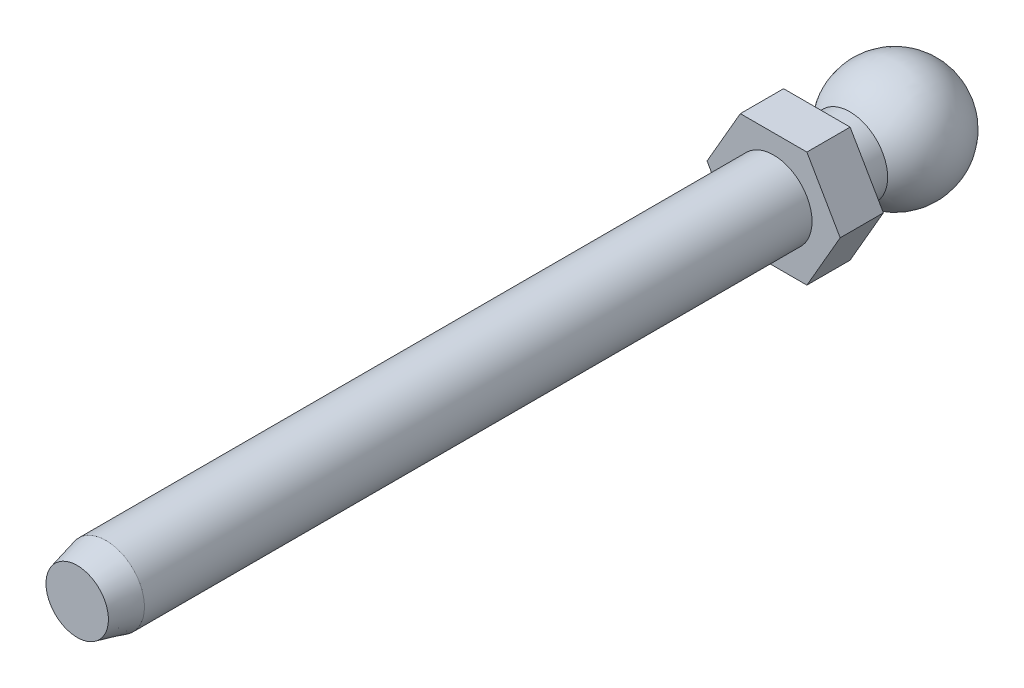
ISO-10303-21;
HEADER;
FILE_DESCRIPTION(('STEP AP214'),'2;1');
FILE_NAME('part.step','',(''),(''),'','','');
FILE_SCHEMA(('AUTOMOTIVE_DESIGN { 1 0 10303 214 1 1 1 1 }'));
ENDSEC;
DATA;
#1=APPLICATION_CONTEXT('core data for automotive mechanical design processes');
#2=APPLICATION_PROTOCOL_DEFINITION('international standard','automotive_design',2000,#1);
#3=PRODUCT_CONTEXT('',#1,'mechanical');
#4=PRODUCT('Part','Part','',(#3));
#5=PRODUCT_RELATED_PRODUCT_CATEGORY('part','',(#4));
#6=PRODUCT_DEFINITION_FORMATION('','',#4);
#7=PRODUCT_DEFINITION_CONTEXT('part definition',#1,'design');
#8=PRODUCT_DEFINITION('design','',#6,#7);
#9=PRODUCT_DEFINITION_SHAPE('','',#8);
#10=(LENGTH_UNIT() NAMED_UNIT(*) SI_UNIT(.MILLI.,.METRE.));
#11=(NAMED_UNIT(*) PLANE_ANGLE_UNIT() SI_UNIT($,.RADIAN.));
#12=(NAMED_UNIT(*) SI_UNIT($,.STERADIAN.) SOLID_ANGLE_UNIT());
#13=UNCERTAINTY_MEASURE_WITH_UNIT(LENGTH_MEASURE(1.E-05),#10,'distance_accuracy_value','');
#14=(GEOMETRIC_REPRESENTATION_CONTEXT(3) GLOBAL_UNCERTAINTY_ASSIGNED_CONTEXT((#13)) GLOBAL_UNIT_ASSIGNED_CONTEXT((#10,
#11,#12)) REPRESENTATION_CONTEXT('',''));
#15=CARTESIAN_POINT('',(0.,0.,0.));
#16=DIRECTION('',(0.,0.,1.));
#17=DIRECTION('',(1.,0.,0.));
#18=AXIS2_PLACEMENT_3D('',#15,#16,#17);
#19=CARTESIAN_POINT('',(0.,0.,0.));
#20=DIRECTION('',(1.,0.,0.));
#21=DIRECTION('',(0.,1.,0.));
#22=AXIS2_PLACEMENT_3D('',#19,#20,#21);
#23=SPHERICAL_SURFACE('',#22,12.25);
#24=CARTESIAN_POINT('',(-12.25,0.,0.));
#25=VERTEX_POINT('',#24);
#26=VERTEX_LOOP('',#25);
#27=FACE_BOUND('',#26,.T.);
#28=CARTESIAN_POINT('',(12.25,0.,0.));
#29=VERTEX_POINT('',#28);
#30=VERTEX_LOOP('',#29);
#31=FACE_BOUND('',#30,.T.);
#32=CARTESIAN_POINT('',(0.,0.,9.38332963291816));
#33=DIRECTION('',(0.,0.,1.));
#34=DIRECTION('',(1.,0.,0.));
#35=AXIS2_PLACEMENT_3D('',#32,#33,#34);
#36=CIRCLE('',#35,7.875);
#37=CARTESIAN_POINT('',(7.875,0.,9.38332963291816));
#38=VERTEX_POINT('',#37);
#39=EDGE_CURVE('E20',#38,#38,#36,.T.);
#40=ORIENTED_EDGE('',*,*,#39,.F.);
#41=EDGE_LOOP('',(#40));
#42=FACE_BOUND('',#41,.T.);
#43=ADVANCED_FACE('F16',(#27,#31,#42),#23,.T.);
#44=CARTESIAN_POINT('',(0.,0.,0.));
#45=DIRECTION('',(0.,0.,1.));
#46=DIRECTION('',(1.,0.,0.));
#47=AXIS2_PLACEMENT_3D('',#44,#45,#46);
#48=CYLINDRICAL_SURFACE('',#47,7.875);
#49=ORIENTED_EDGE('',*,*,#39,.T.);
#50=EDGE_LOOP('',(#49));
#51=FACE_BOUND('',#50,.T.);
#52=CARTESIAN_POINT('',(0.,0.,16.25));
#53=DIRECTION('',(0.,0.,1.));
#54=DIRECTION('',(1.,0.,0.));
#55=AXIS2_PLACEMENT_3D('',#52,#53,#54);
#56=CIRCLE('',#55,7.875);
#57=CARTESIAN_POINT('',(7.875,0.,16.25));
#58=VERTEX_POINT('',#57);
#59=EDGE_CURVE('E79',#58,#58,#56,.F.);
#60=ORIENTED_EDGE('',*,*,#59,.T.);
#61=EDGE_LOOP('',(#60));
#62=FACE_BOUND('',#61,.T.);
#63=ADVANCED_FACE('F74',(#51,#62),#48,.T.);
#64=CARTESIAN_POINT('',(0.,0.,16.25));
#65=DIRECTION('',(0.,0.,1.));
#66=DIRECTION('',(1.,0.,0.));
#67=AXIS2_PLACEMENT_3D('',#64,#65,#66);
#68=PLANE('',#67);
#69=ORIENTED_EDGE('',*,*,#59,.F.);
#70=EDGE_LOOP('',(#69));
#71=FACE_BOUND('',#70,.T.);
#72=DIRECTION('',(-0.5,0.866025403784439,0.));
#73=VECTOR('',#72,1.);
#74=CARTESIAN_POINT('',(6.92820323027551,12.,16.25));
#75=LINE('',#74,#73);
#76=CARTESIAN_POINT('',(13.856406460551,0.,16.25));
#77=VERTEX_POINT('',#76);
#78=CARTESIAN_POINT('',(6.92820323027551,12.,16.25));
#79=VERTEX_POINT('',#78);
#80=EDGE_CURVE('E81',#77,#79,#75,.T.);
#81=ORIENTED_EDGE('',*,*,#80,.F.);
#82=DIRECTION('',(0.5,0.866025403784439,0.));
#83=VECTOR('',#82,1.);
#84=CARTESIAN_POINT('',(13.856406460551,0.,16.25));
#85=LINE('',#84,#83);
#86=CARTESIAN_POINT('',(6.92820323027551,-12.,16.25));
#87=VERTEX_POINT('',#86);
#88=EDGE_CURVE('E114',#87,#77,#85,.T.);
#89=ORIENTED_EDGE('',*,*,#88,.F.);
#90=DIRECTION('',(1.,0.,0.));
#91=VECTOR('',#90,1.);
#92=CARTESIAN_POINT('',(6.92820323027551,-12.,16.25));
#93=LINE('',#92,#91);
#94=CARTESIAN_POINT('',(-6.92820323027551,-12.,16.25));
#95=VERTEX_POINT('',#94);
#96=EDGE_CURVE('E111',#95,#87,#93,.T.);
#97=ORIENTED_EDGE('',*,*,#96,.F.);
#98=DIRECTION('',(0.5,-0.866025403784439,0.));
#99=VECTOR('',#98,1.);
#100=CARTESIAN_POINT('',(-6.92820323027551,-12.,16.25));
#101=LINE('',#100,#99);
#102=CARTESIAN_POINT('',(-13.856406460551,0.,16.25));
#103=VERTEX_POINT('',#102);
#104=EDGE_CURVE('E106',#103,#95,#101,.T.);
#105=ORIENTED_EDGE('',*,*,#104,.F.);
#106=DIRECTION('',(-0.5,-0.866025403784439,0.));
#107=VECTOR('',#106,1.);
#108=CARTESIAN_POINT('',(-13.856406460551,0.,16.25));
#109=LINE('',#108,#107);
#110=CARTESIAN_POINT('',(-6.92820323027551,12.,16.25));
#111=VERTEX_POINT('',#110);
#112=EDGE_CURVE('E101',#111,#103,#109,.T.);
#113=ORIENTED_EDGE('',*,*,#112,.F.);
#114=DIRECTION('',(1.,0.,0.));
#115=VECTOR('',#114,1.);
#116=CARTESIAN_POINT('',(-6.92820323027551,12.,16.25));
#117=LINE('',#116,#115);
#118=EDGE_CURVE('E96',#79,#111,#117,.F.);
#119=ORIENTED_EDGE('',*,*,#118,.F.);
#120=EDGE_LOOP('',(#81,#89,#97,#105,#113,#119));
#121=FACE_BOUND('',#120,.T.);
#122=ADVANCED_FACE('F235',(#71,#121),#68,.F.);
#123=CARTESIAN_POINT('',(6.92820323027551,12.,16.25));
#124=DIRECTION('',(0.866025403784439,0.5,0.));
#125=DIRECTION('',(-0.5,0.866025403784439,0.));
#126=AXIS2_PLACEMENT_3D('',#123,#124,#125);
#127=PLANE('',#126);
#128=ORIENTED_EDGE('',*,*,#80,.T.);
#129=DIRECTION('',(0.,0.,1.));
#130=VECTOR('',#129,1.);
#131=CARTESIAN_POINT('',(6.92820323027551,12.,16.25));
#132=LINE('',#131,#130);
#133=CARTESIAN_POINT('',(6.92820323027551,12.,25.25));
#134=VERTEX_POINT('',#133);
#135=EDGE_CURVE('E84',#134,#79,#132,.F.);
#136=ORIENTED_EDGE('',*,*,#135,.F.);
#137=DIRECTION('',(-0.5,0.866025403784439,0.));
#138=VECTOR('',#137,1.);
#139=CARTESIAN_POINT('',(13.856406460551,0.,25.25));
#140=LINE('',#139,#138);
#141=CARTESIAN_POINT('',(13.856406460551,0.,25.25));
#142=VERTEX_POINT('',#141);
#143=EDGE_CURVE('E120',#142,#134,#140,.T.);
#144=ORIENTED_EDGE('',*,*,#143,.F.);
#145=DIRECTION('',(0.,0.,1.));
#146=VECTOR('',#145,1.);
#147=CARTESIAN_POINT('',(13.856406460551,0.,16.25));
#148=LINE('',#147,#146);
#149=EDGE_CURVE('E117',#77,#142,#148,.T.);
#150=ORIENTED_EDGE('',*,*,#149,.F.);
#151=EDGE_LOOP('',(#128,#136,#144,#150));
#152=FACE_BOUND('',#151,.T.);
#153=ADVANCED_FACE('F145',(#152),#127,.T.);
#154=CARTESIAN_POINT('',(-6.92820323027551,12.,16.25));
#155=DIRECTION('',(0.,1.,0.));
#156=DIRECTION('',(0.,0.,1.));
#157=AXIS2_PLACEMENT_3D('',#154,#155,#156);
#158=PLANE('',#157);
#159=ORIENTED_EDGE('',*,*,#118,.T.);
#160=DIRECTION('',(0.,0.,1.));
#161=VECTOR('',#160,1.);
#162=CARTESIAN_POINT('',(-6.92820323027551,12.,16.25));
#163=LINE('',#162,#161);
#164=CARTESIAN_POINT('',(-6.92820323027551,12.,25.25));
#165=VERTEX_POINT('',#164);
#166=EDGE_CURVE('E98',#165,#111,#163,.F.);
#167=ORIENTED_EDGE('',*,*,#166,.F.);
#168=DIRECTION('',(1.,0.,0.));
#169=VECTOR('',#168,1.);
#170=CARTESIAN_POINT('',(0.,12.,25.25));
#171=LINE('',#170,#169);
#172=EDGE_CURVE('E123',#134,#165,#171,.F.);
#173=ORIENTED_EDGE('',*,*,#172,.F.);
#174=ORIENTED_EDGE('',*,*,#135,.T.);
#175=EDGE_LOOP('',(#159,#167,#173,#174));
#176=FACE_BOUND('',#175,.T.);
#177=ADVANCED_FACE('F149',(#176),#158,.T.);
#178=CARTESIAN_POINT('',(-13.856406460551,0.,16.25));
#179=DIRECTION('',(-0.866025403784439,0.5,0.));
#180=DIRECTION('',(-0.5,-0.866025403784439,0.));
#181=AXIS2_PLACEMENT_3D('',#178,#179,#180);
#182=PLANE('',#181);
#183=ORIENTED_EDGE('',*,*,#112,.T.);
#184=DIRECTION('',(0.,0.,1.));
#185=VECTOR('',#184,1.);
#186=CARTESIAN_POINT('',(-13.856406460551,0.,16.25));
#187=LINE('',#186,#185);
#188=CARTESIAN_POINT('',(-13.856406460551,0.,25.25));
#189=VERTEX_POINT('',#188);
#190=EDGE_CURVE('E103',#189,#103,#187,.F.);
#191=ORIENTED_EDGE('',*,*,#190,.F.);
#192=DIRECTION('',(-0.5,-0.866025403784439,0.));
#193=VECTOR('',#192,1.);
#194=CARTESIAN_POINT('',(-6.92820323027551,12.,25.25));
#195=LINE('',#194,#193);
#196=EDGE_CURVE('E126',#165,#189,#195,.T.);
#197=ORIENTED_EDGE('',*,*,#196,.F.);
#198=ORIENTED_EDGE('',*,*,#166,.T.);
#199=EDGE_LOOP('',(#183,#191,#197,#198));
#200=FACE_BOUND('',#199,.T.);
#201=ADVANCED_FACE('F153',(#200),#182,.T.);
#202=CARTESIAN_POINT('',(-6.92820323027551,-12.,16.25));
#203=DIRECTION('',(-0.866025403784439,-0.5,0.));
#204=DIRECTION('',(0.5,-0.866025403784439,0.));
#205=AXIS2_PLACEMENT_3D('',#202,#203,#204);
#206=PLANE('',#205);
#207=ORIENTED_EDGE('',*,*,#104,.T.);
#208=DIRECTION('',(0.,0.,-1.));
#209=VECTOR('',#208,1.);
#210=CARTESIAN_POINT('',(-6.92820323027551,-12.,16.25));
#211=LINE('',#210,#209);
#212=CARTESIAN_POINT('',(-6.92820323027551,-12.,25.25));
#213=VERTEX_POINT('',#212);
#214=EDGE_CURVE('E108',#213,#95,#211,.T.);
#215=ORIENTED_EDGE('',*,*,#214,.F.);
#216=DIRECTION('',(0.5,-0.866025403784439,0.));
#217=VECTOR('',#216,1.);
#218=CARTESIAN_POINT('',(-13.856406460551,0.,25.25));
#219=LINE('',#218,#217);
#220=EDGE_CURVE('E129',#189,#213,#219,.T.);
#221=ORIENTED_EDGE('',*,*,#220,.F.);
#222=ORIENTED_EDGE('',*,*,#190,.T.);
#223=EDGE_LOOP('',(#207,#215,#221,#222));
#224=FACE_BOUND('',#223,.T.);
#225=ADVANCED_FACE('F157',(#224),#206,.T.);
#226=CARTESIAN_POINT('',(6.92820323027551,-12.,16.25));
#227=DIRECTION('',(0.,-1.,0.));
#228=DIRECTION('',(0.,0.,-1.));
#229=AXIS2_PLACEMENT_3D('',#226,#227,#228);
#230=PLANE('',#229);
#231=ORIENTED_EDGE('',*,*,#96,.T.);
#232=DIRECTION('',(0.,0.,1.));
#233=VECTOR('',#232,1.);
#234=CARTESIAN_POINT('',(6.92820323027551,-12.,16.25));
#235=LINE('',#234,#233);
#236=CARTESIAN_POINT('',(6.92820323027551,-12.,25.25));
#237=VERTEX_POINT('',#236);
#238=EDGE_CURVE('E35',#237,#87,#235,.F.);
#239=ORIENTED_EDGE('',*,*,#238,.F.);
#240=DIRECTION('',(1.,0.,0.));
#241=VECTOR('',#240,1.);
#242=CARTESIAN_POINT('',(0.,-12.,25.25));
#243=LINE('',#242,#241);
#244=EDGE_CURVE('E132',#213,#237,#243,.T.);
#245=ORIENTED_EDGE('',*,*,#244,.F.);
#246=ORIENTED_EDGE('',*,*,#214,.T.);
#247=EDGE_LOOP('',(#231,#239,#245,#246));
#248=FACE_BOUND('',#247,.T.);
#249=ADVANCED_FACE('F159',(#248),#230,.T.);
#250=CARTESIAN_POINT('',(13.856406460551,0.,16.25));
#251=DIRECTION('',(0.866025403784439,-0.5,0.));
#252=DIRECTION('',(0.5,0.866025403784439,0.));
#253=AXIS2_PLACEMENT_3D('',#250,#251,#252);
#254=PLANE('',#253);
#255=ORIENTED_EDGE('',*,*,#88,.T.);
#256=ORIENTED_EDGE('',*,*,#149,.T.);
#257=DIRECTION('',(0.5,0.866025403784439,0.));
#258=VECTOR('',#257,1.);
#259=CARTESIAN_POINT('',(6.92820323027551,-12.,25.25));
#260=LINE('',#259,#258);
#261=EDGE_CURVE('E90',#237,#142,#260,.T.);
#262=ORIENTED_EDGE('',*,*,#261,.F.);
#263=ORIENTED_EDGE('',*,*,#238,.T.);
#264=EDGE_LOOP('',(#255,#256,#262,#263));
#265=FACE_BOUND('',#264,.T.);
#266=ADVANCED_FACE('F141',(#265),#254,.T.);
#267=CARTESIAN_POINT('',(0.,0.,170.25));
#268=DIRECTION('',(0.,0.,-1.));
#269=DIRECTION('',(-1.,0.,0.));
#270=AXIS2_PLACEMENT_3D('',#267,#268,#269);
#271=PLANE('',#270);
#272=CARTESIAN_POINT('',(0.,0.,170.25000000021));
#273=DIRECTION('',(0.,0.,-1.));
#274=DIRECTION('',(0.,1.,0.));
#275=AXIS2_PLACEMENT_3D('',#272,#273,#274);
#276=CIRCLE('',#275,6.50000000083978);
#277=CARTESIAN_POINT('',(0.,6.50000000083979,170.25000000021));
#278=VERTEX_POINT('',#277);
#279=EDGE_CURVE('E87',#278,#278,#276,.T.);
#280=ORIENTED_EDGE('',*,*,#279,.F.);
#281=EDGE_LOOP('',(#280));
#282=FACE_BOUND('',#281,.T.);
#283=ADVANCED_FACE('F167',(#282),#271,.F.);
#284=CARTESIAN_POINT('',(0.,0.,25.25));
#285=DIRECTION('',(0.,0.,1.));
#286=DIRECTION('',(1.,0.,0.));
#287=AXIS2_PLACEMENT_3D('',#284,#285,#286);
#288=PLANE('',#287);
#289=CARTESIAN_POINT('',(0.,0.,25.25));
#290=DIRECTION('',(0.,0.,1.));
#291=DIRECTION('',(1.,0.,0.));
#292=AXIS2_PLACEMENT_3D('',#289,#290,#291);
#293=CIRCLE('',#292,8.);
#294=CARTESIAN_POINT('',(8.,0.,25.25));
#295=VERTEX_POINT('',#294);
#296=EDGE_CURVE('E26',#295,#295,#293,.T.);
#297=ORIENTED_EDGE('',*,*,#296,.F.);
#298=EDGE_LOOP('',(#297));
#299=FACE_BOUND('',#298,.T.);
#300=ORIENTED_EDGE('',*,*,#244,.T.);
#301=ORIENTED_EDGE('',*,*,#261,.T.);
#302=ORIENTED_EDGE('',*,*,#143,.T.);
#303=ORIENTED_EDGE('',*,*,#172,.T.);
#304=ORIENTED_EDGE('',*,*,#196,.T.);
#305=ORIENTED_EDGE('',*,*,#220,.T.);
#306=EDGE_LOOP('',(#300,#301,#302,#303,#304,#305));
#307=FACE_BOUND('',#306,.T.);
#308=ADVANCED_FACE('F139',(#299,#307),#288,.T.);
#309=CARTESIAN_POINT('',(0.,0.,164.24999999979));
#310=DIRECTION('',(0.,0.,-1.));
#311=DIRECTION('',(0.,1.,0.));
#312=AXIS2_PLACEMENT_3D('',#309,#310,#311);
#313=CONICAL_SURFACE('',#312,7.99999999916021,0.244978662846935);
#314=CARTESIAN_POINT('',(0.,0.,164.25));
#315=DIRECTION('',(0.,0.,1.));
#316=DIRECTION('',(1.,0.,0.));
#317=AXIS2_PLACEMENT_3D('',#314,#315,#316);
#318=CIRCLE('',#317,8.);
#319=CARTESIAN_POINT('',(8.,0.,164.25));
#320=VERTEX_POINT('',#319);
#321=EDGE_CURVE('E11',#320,#320,#318,.F.);
#322=ORIENTED_EDGE('',*,*,#321,.F.);
#323=EDGE_LOOP('',(#322));
#324=FACE_BOUND('',#323,.T.);
#325=ORIENTED_EDGE('',*,*,#279,.T.);
#326=EDGE_LOOP('',(#325));
#327=FACE_BOUND('',#326,.T.);
#328=ADVANCED_FACE('F172',(#324,#327),#313,.T.);
#329=CARTESIAN_POINT('',(0.,0.,25.25));
#330=DIRECTION('',(0.,0.,1.));
#331=DIRECTION('',(1.,0.,0.));
#332=AXIS2_PLACEMENT_3D('',#329,#330,#331);
#333=CYLINDRICAL_SURFACE('',#332,8.);
#334=ORIENTED_EDGE('',*,*,#321,.T.);
#335=EDGE_LOOP('',(#334));
#336=FACE_BOUND('',#335,.T.);
#337=ORIENTED_EDGE('',*,*,#296,.T.);
#338=EDGE_LOOP('',(#337));
#339=FACE_BOUND('',#338,.T.);
#340=ADVANCED_FACE('F170',(#336,#339),#333,.T.);
#341=CLOSED_SHELL('',(#43,#63,#122,#153,#177,#201,#225,#249,#266,#283,#308,#328,#340));
#342=MANIFOLD_SOLID_BREP('B1',#341);
#343=ADVANCED_BREP_SHAPE_REPRESENTATION('',(#18,#342),#14);
#344=SHAPE_DEFINITION_REPRESENTATION(#9,#343);
ENDSEC;
END-ISO-10303-21;
